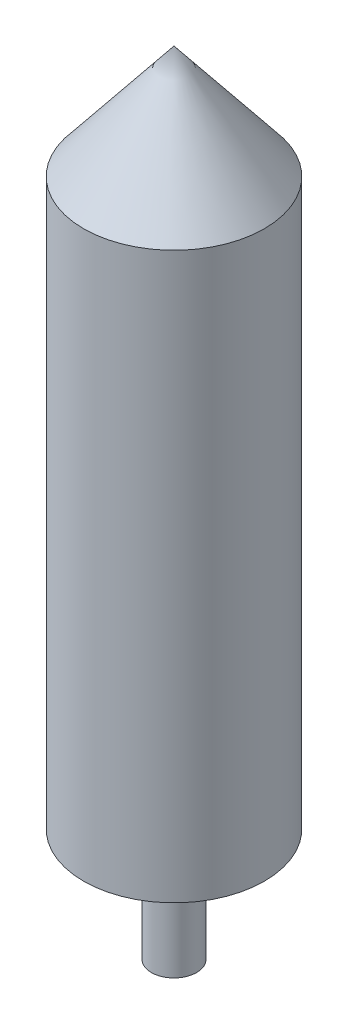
from build123d import *


with BuildPart() as part:
    # Sketch1 → Revolve8 (revolve)
    with BuildSketch(Plane.XY, mode=Mode.PRIVATE) as revolve8_sk:
        Polygon((2, 10), (8, 10), (8, 60), (0, 70), (0, 0), (2, 0), align=None)
    revolve(revolve8_sk.sketch.rotate(Axis((0, 70, 0), (0, -1, 0)), 180), axis=Axis((0, 70, 0), (0, -1, 0)))


solid = part.part
